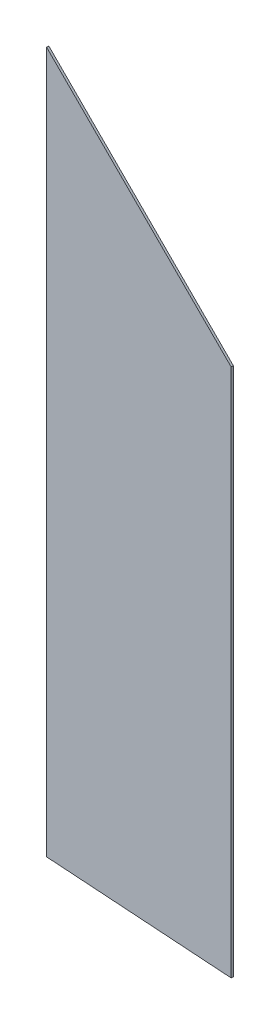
ISO-10303-21;
HEADER;
FILE_DESCRIPTION(('STEP AP214'),'2;1');
FILE_NAME('part.step','',(''),(''),'','','');
FILE_SCHEMA(('AUTOMOTIVE_DESIGN { 1 0 10303 214 1 1 1 1 }'));
ENDSEC;
DATA;
#1=APPLICATION_CONTEXT('core data for automotive mechanical design processes');
#2=APPLICATION_PROTOCOL_DEFINITION('international standard','automotive_design',2000,#1);
#3=PRODUCT_CONTEXT('',#1,'mechanical');
#4=PRODUCT('Part','Part','',(#3));
#5=PRODUCT_RELATED_PRODUCT_CATEGORY('part','',(#4));
#6=PRODUCT_DEFINITION_FORMATION('','',#4);
#7=PRODUCT_DEFINITION_CONTEXT('part definition',#1,'design');
#8=PRODUCT_DEFINITION('design','',#6,#7);
#9=PRODUCT_DEFINITION_SHAPE('','',#8);
#10=(LENGTH_UNIT() NAMED_UNIT(*) SI_UNIT(.MILLI.,.METRE.));
#11=(NAMED_UNIT(*) PLANE_ANGLE_UNIT() SI_UNIT($,.RADIAN.));
#12=(NAMED_UNIT(*) SI_UNIT($,.STERADIAN.) SOLID_ANGLE_UNIT());
#13=UNCERTAINTY_MEASURE_WITH_UNIT(LENGTH_MEASURE(1.E-05),#10,'distance_accuracy_value','');
#14=(GEOMETRIC_REPRESENTATION_CONTEXT(3) GLOBAL_UNCERTAINTY_ASSIGNED_CONTEXT((#13)) GLOBAL_UNIT_ASSIGNED_CONTEXT((#10,
#11,#12)) REPRESENTATION_CONTEXT('',''));
#15=CARTESIAN_POINT('',(0.,0.,0.));
#16=DIRECTION('',(0.,0.,1.));
#17=DIRECTION('',(1.,0.,0.));
#18=AXIS2_PLACEMENT_3D('',#15,#16,#17);
#19=CARTESIAN_POINT('',(-534.9875,2068.5125,-6.35));
#20=DIRECTION('',(-1.,0.,0.));
#21=DIRECTION('',(0.,-1.,0.));
#22=AXIS2_PLACEMENT_3D('',#19,#20,#21);
#23=PLANE('',#22);
#24=DIRECTION('',(0.,-1.,0.));
#25=VECTOR('',#24,1.);
#26=CARTESIAN_POINT('',(-534.9875,2068.5125,-6.35));
#27=LINE('',#26,#25);
#28=CARTESIAN_POINT('',(-534.9875,2068.5125,-6.35));
#29=VERTEX_POINT('',#28);
#30=CARTESIAN_POINT('',(-534.9875,36.5125000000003,-6.35));
#31=VERTEX_POINT('',#30);
#32=EDGE_CURVE('E91',#29,#31,#27,.T.);
#33=ORIENTED_EDGE('',*,*,#32,.T.);
#34=DIRECTION('',(0.,0.,1.));
#35=VECTOR('',#34,1.);
#36=CARTESIAN_POINT('',(-534.9875,36.5125000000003,0.));
#37=LINE('',#36,#35);
#38=CARTESIAN_POINT('',(-534.9875,36.5125000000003,0.));
#39=VERTEX_POINT('',#38);
#40=EDGE_CURVE('E86',#39,#31,#37,.F.);
#41=ORIENTED_EDGE('',*,*,#40,.F.);
#42=DIRECTION('',(0.,-1.,0.));
#43=VECTOR('',#42,1.);
#44=CARTESIAN_POINT('',(-534.9875,2068.5125,0.));
#45=LINE('',#44,#43);
#46=CARTESIAN_POINT('',(-534.9875,2068.5125,0.));
#47=VERTEX_POINT('',#46);
#48=EDGE_CURVE('E81',#47,#39,#45,.T.);
#49=ORIENTED_EDGE('',*,*,#48,.F.);
#50=DIRECTION('',(0.,0.,1.));
#51=VECTOR('',#50,1.);
#52=CARTESIAN_POINT('',(-534.9875,2068.5125,-6.35));
#53=LINE('',#52,#51);
#54=EDGE_CURVE('E11',#29,#47,#53,.T.);
#55=ORIENTED_EDGE('',*,*,#54,.F.);
#56=EDGE_LOOP('',(#33,#41,#49,#55));
#57=FACE_BOUND('',#56,.T.);
#58=ADVANCED_FACE('F36',(#57),#23,.T.);
#59=CARTESIAN_POINT('',(0.,0.,-6.35));
#60=DIRECTION('',(0.,0.,1.));
#61=DIRECTION('',(1.,0.,0.));
#62=AXIS2_PLACEMENT_3D('',#59,#60,#61);
#63=PLANE('',#62);
#64=DIRECTION('',(-0.997679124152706,0.0680908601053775,0.));
#65=VECTOR('',#64,1.);
#66=CARTESIAN_POINT('',(0.,0.,-6.35));
#67=LINE('',#66,#65);
#68=CARTESIAN_POINT('',(0.,0.,-6.35));
#69=VERTEX_POINT('',#68);
#70=EDGE_CURVE('E98',#69,#31,#67,.T.);
#71=ORIENTED_EDGE('',*,*,#70,.T.);
#72=ORIENTED_EDGE('',*,*,#32,.F.);
#73=DIRECTION('',(-0.707106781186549,0.707106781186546,0.));
#74=VECTOR('',#73,1.);
#75=CARTESIAN_POINT('',(0.,1533.525,-6.35));
#76=LINE('',#75,#74);
#77=CARTESIAN_POINT('',(0.,1533.525,-6.35));
#78=VERTEX_POINT('',#77);
#79=EDGE_CURVE('E74',#78,#29,#76,.T.);
#80=ORIENTED_EDGE('',*,*,#79,.F.);
#81=DIRECTION('',(0.,1.,0.));
#82=VECTOR('',#81,1.);
#83=CARTESIAN_POINT('',(0.,0.,-6.35));
#84=LINE('',#83,#82);
#85=EDGE_CURVE('E87',#69,#78,#84,.T.);
#86=ORIENTED_EDGE('',*,*,#85,.F.);
#87=EDGE_LOOP('',(#71,#72,#80,#86));
#88=FACE_BOUND('',#87,.T.);
#89=ADVANCED_FACE('F109',(#88),#63,.F.);
#90=CARTESIAN_POINT('',(0.,0.,0.));
#91=DIRECTION('',(0.,0.,1.));
#92=DIRECTION('',(1.,0.,0.));
#93=AXIS2_PLACEMENT_3D('',#90,#91,#92);
#94=PLANE('',#93);
#95=ORIENTED_EDGE('',*,*,#48,.T.);
#96=DIRECTION('',(-0.997679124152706,0.0680908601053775,0.));
#97=VECTOR('',#96,1.);
#98=CARTESIAN_POINT('',(0.,0.,0.));
#99=LINE('',#98,#97);
#100=CARTESIAN_POINT('',(0.,0.,0.));
#101=VERTEX_POINT('',#100);
#102=EDGE_CURVE('E101',#101,#39,#99,.T.);
#103=ORIENTED_EDGE('',*,*,#102,.F.);
#104=DIRECTION('',(0.,1.,0.));
#105=VECTOR('',#104,1.);
#106=CARTESIAN_POINT('',(0.,0.,0.));
#107=LINE('',#106,#105);
#108=CARTESIAN_POINT('',(0.,1533.525,0.));
#109=VERTEX_POINT('',#108);
#110=EDGE_CURVE('E82',#101,#109,#107,.T.);
#111=ORIENTED_EDGE('',*,*,#110,.T.);
#112=DIRECTION('',(-0.707106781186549,0.707106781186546,0.));
#113=VECTOR('',#112,1.);
#114=CARTESIAN_POINT('',(0.,1533.525,0.));
#115=LINE('',#114,#113);
#116=EDGE_CURVE('E71',#109,#47,#115,.T.);
#117=ORIENTED_EDGE('',*,*,#116,.T.);
#118=EDGE_LOOP('',(#95,#103,#111,#117));
#119=FACE_BOUND('',#118,.T.);
#120=ADVANCED_FACE('F78',(#119),#94,.T.);
#121=CARTESIAN_POINT('',(0.,1533.525,-6.35));
#122=DIRECTION('',(0.707106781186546,0.707106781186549,0.));
#123=DIRECTION('',(-0.707106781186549,0.707106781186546,0.));
#124=AXIS2_PLACEMENT_3D('',#121,#122,#123);
#125=PLANE('',#124);
#126=ORIENTED_EDGE('',*,*,#116,.F.);
#127=DIRECTION('',(0.,0.,1.));
#128=VECTOR('',#127,1.);
#129=CARTESIAN_POINT('',(0.,1533.525,-6.35));
#130=LINE('',#129,#128);
#131=EDGE_CURVE('E46',#78,#109,#130,.T.);
#132=ORIENTED_EDGE('',*,*,#131,.F.);
#133=ORIENTED_EDGE('',*,*,#79,.T.);
#134=ORIENTED_EDGE('',*,*,#54,.T.);
#135=EDGE_LOOP('',(#126,#132,#133,#134));
#136=FACE_BOUND('',#135,.T.);
#137=ADVANCED_FACE('F70',(#136),#125,.T.);
#138=CARTESIAN_POINT('',(0.,0.,-6.35));
#139=DIRECTION('',(1.,0.,0.));
#140=DIRECTION('',(0.,1.,0.));
#141=AXIS2_PLACEMENT_3D('',#138,#139,#140);
#142=PLANE('',#141);
#143=ORIENTED_EDGE('',*,*,#110,.F.);
#144=DIRECTION('',(0.,0.,1.));
#145=VECTOR('',#144,1.);
#146=CARTESIAN_POINT('',(0.,0.,-6.35));
#147=LINE('',#146,#145);
#148=EDGE_CURVE('E40',#69,#101,#147,.T.);
#149=ORIENTED_EDGE('',*,*,#148,.F.);
#150=ORIENTED_EDGE('',*,*,#85,.T.);
#151=ORIENTED_EDGE('',*,*,#131,.T.);
#152=EDGE_LOOP('',(#143,#149,#150,#151));
#153=FACE_BOUND('',#152,.T.);
#154=ADVANCED_FACE('F38',(#153),#142,.T.);
#155=CARTESIAN_POINT('',(0.,0.,0.));
#156=DIRECTION('',(0.0680908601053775,0.997679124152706,0.));
#157=DIRECTION('',(-0.997679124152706,0.0680908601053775,0.));
#158=AXIS2_PLACEMENT_3D('',#155,#156,#157);
#159=PLANE('',#158);
#160=ORIENTED_EDGE('',*,*,#102,.T.);
#161=ORIENTED_EDGE('',*,*,#40,.T.);
#162=ORIENTED_EDGE('',*,*,#70,.F.);
#163=ORIENTED_EDGE('',*,*,#148,.T.);
#164=EDGE_LOOP('',(#160,#161,#162,#163));
#165=FACE_BOUND('',#164,.T.);
#166=ADVANCED_FACE('F104',(#165),#159,.F.);
#167=CLOSED_SHELL('',(#58,#89,#120,#137,#154,#166));
#168=MANIFOLD_SOLID_BREP('B2',#167);
#169=ADVANCED_BREP_SHAPE_REPRESENTATION('',(#18,#168),#14);
#170=SHAPE_DEFINITION_REPRESENTATION(#9,#169);
ENDSEC;
END-ISO-10303-21;
